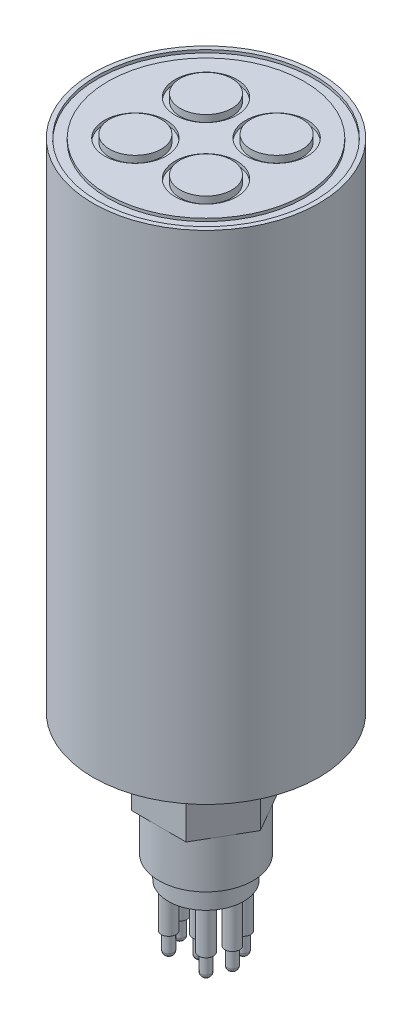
from build123d import *

# Parameters (mm, degrees)
SKETCH1_R                       = 22.86
BOSS_EXTRUDE1_DEPTH             = 100.584
SKETCH2_R                       = 21.9456
SKETCH2_R_2                     = 19.8628
CUT_EXTRUDE1_DEPTH              = 0.5842
SKETCH4_R                       = 6.25475
CUT_EXTRUDE4_DEPTH              = 0.7112
SKETCH5_R                       = 5.2324
BOSS_EXTRUDE2_DEPTH             = 1.397
BOSS_EXTRUDE3_DEPTH             = 15.24
SKETCH8_R                       = 9.525
BOSS_EXTRUDE4_DEPTH             = 9.525
SKETCH9_R                       = 7.62
BOSS_EXTRUDE5_DEPTH             = 4.572
SKETCH10_R                      = 1.4859
BOSS_EXTRUDE6_DEPTH             = 8.89
SKETCH12_R                      = 1.016
BOSS_EXTRUDE7_DEPTH             = 4.318
FILLET4_R                       = 0.9525
CIRPATTERN1_COUNT               = 7
CIRPATTERN1_ANGLE               = 270
FILLET4_OF_CIRPATTERN1_R        = 0.9525
LPATTERN2_COUNT                 = 2
LPATTERN2_PITCH                 = 3.7719
LPATTERN2_COUNT_DIR2            = 2
LPATTERN2_PITCH_DIR2            = 2.54
FILLET4_OF_LPATTERN2_R          = 0.9525
F_6_32_TAPPED_HOLE1_D           = 2.7051
F_6_32_TAPPED_HOLE1_DEPTH       = 9.398
F_6_32_TAPPED_HOLE1_CBORE_D     = 3.5052
F_6_32_TAPPED_HOLE1_CBORE_DEPTH = 7.112
F_6_32_TAPPED_HOLE1_TIP         = 0.81269403


with BuildPart() as part:
    # Sketch1 → Boss-Extrude1 (new body)
    with BuildSketch(Plane(origin=(0, 0, 0), x_dir=(1, 0, 0), z_dir=(0, 1, 0))):
        with Locations(Location((0, 0, 0), (0, 0, 270))):
            Circle(SKETCH1_R)
    extrude(amount=BOSS_EXTRUDE1_DEPTH)

    # Sketch2 → Cut-Extrude1 (cut)
    with BuildSketch(Plane(origin=(0, 100.584, 0), x_dir=(1, 0, 0), z_dir=(0, 1, 0))):
        with Locations(Location((0, 0, 0), (0, 0, 270))):
            Circle(SKETCH2_R)
        with Locations(Location((0, 0, 0), (0, 0, 270))):
            Circle(SKETCH2_R_2, mode=Mode.SUBTRACT)
    extrude(amount=-CUT_EXTRUDE1_DEPTH, mode=Mode.SUBTRACT)

    # Sketch4 → Cut-Extrude4 (cut)
    with BuildSketch(Plane(origin=(0, 100.584, 0), x_dir=(1, 0, 0), z_dir=(0, 1, 0))):
        with Locations(Location((-7.14375, 7.14375, 0), (0, 0, 270))):
            Circle(SKETCH4_R)
        with Locations(Location((7.14375, 7.14375, 0), (0, 0, 90))):
            Circle(SKETCH4_R)
        with Locations(Location((7.14375, -7.14375, 0), (0, 0, 270))):
            Circle(SKETCH4_R)
        with Locations(Location((-7.14375, -7.14375, 0), (0, 0, 90))):
            Circle(SKETCH4_R)
    extrude(amount=-CUT_EXTRUDE4_DEPTH, mode=Mode.SUBTRACT)

    # Sketch5 → Boss-Extrude2 (add)
    with BuildSketch(Plane(origin=(0, 99.8728, 0), x_dir=(1, 0, 0), z_dir=(0, 1, 0))):
        with Locations(Location((-7.14375, 7.14375, 0), (0, 0, 270))):
            Circle(SKETCH5_R)
        with Locations(Location((7.14375, 7.14375, 0), (0, 0, 90))):
            Circle(SKETCH5_R)
        with Locations(Location((7.14375, -7.14375, 0), (0, 0, 270))):
            Circle(SKETCH5_R)
        with Locations(Location((-7.14375, -7.14375, 0), (0, 0, 90))):
            Circle(SKETCH5_R)
    extrude(amount=BOSS_EXTRUDE2_DEPTH)

    # Sketch7 → Boss-Extrude3 (add)
    with BuildSketch(Plane.XZ):
        Polygon((5.499261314, 9.525), (-5.499261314, 9.525), (-10.998522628, 0), (-5.499261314, -9.525), (5.499261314, -9.525), (10.998522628, 0), align=None)
    extrude(amount=BOSS_EXTRUDE3_DEPTH)

    # Sketch8 → Boss-Extrude4 (add)
    with BuildSketch(Plane.XZ.offset(15.24)):
        with Locations(Location((0, 0, 0), (0, 0, 270))):
            Circle(SKETCH8_R)
    extrude(amount=BOSS_EXTRUDE4_DEPTH)

    # Sketch9 → Boss-Extrude5 (add)
    with BuildSketch(Plane.XZ.offset(24.765)):
        with Locations(Location((0, 0, 0), (0, 0, 270))):
            Circle(SKETCH9_R)
    extrude(amount=BOSS_EXTRUDE5_DEPTH)

    # Sketch10 → Boss-Extrude6 (add)
    with BuildSketch(Plane.XZ.offset(29.337)):
        with Locations(Location((3.771707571, 3.771707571, 0), (0, 0, 270))):
            Circle(SKETCH10_R)
    boss_extrude6 = extrude(amount=BOSS_EXTRUDE6_DEPTH)

    # Sketch12 → Boss-Extrude7 (add)
    with BuildSketch(Plane.XZ.offset(38.227)):
        with Locations(Location((3.771707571, 3.771707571, 0), (0, 0, 270))):
            Circle(SKETCH12_R)
    boss_extrude7 = extrude(amount=BOSS_EXTRUDE7_DEPTH)

    # Fillet4
    fillet4_edges = [part.edges().sort_by_distance(p)[0] for p in [
        (3.771707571, -42.545, 4.787707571),
    ]]
    fillet(fillet4_edges, radius=FILLET4_R)

    # CirPattern1: Boss-Extrude6, Boss-Extrude7 ×7 about axis
    cirpattern1_axis = Axis((0, 0, 0), (0, 1, 0))
    add([boss_extrude6.rotate(cirpattern1_axis, i * CIRPATTERN1_ANGLE / (CIRPATTERN1_COUNT - 1)) for i in range(1, CIRPATTERN1_COUNT)])
    add([boss_extrude7.rotate(cirpattern1_axis, i * CIRPATTERN1_ANGLE / (CIRPATTERN1_COUNT - 1)) for i in range(1, CIRPATTERN1_COUNT)])

    # Fillet4 of CirPattern1
    fillet4_of_cirpattern1_edges = [part.edges().sort_by_distance(p)[0] for p in [
        (6.05242049, -42.545, 0.71842049),
        (4.787707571, -42.545, -3.771707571),
        (0.71842049, -42.545, -6.05242049),
        (-3.771707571, -42.545, -4.787707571),
        (-6.05242049, -42.545, -0.71842049),
        (-4.787707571, -42.545, 3.771707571),
    ]]
    fillet(fillet4_of_cirpattern1_edges, radius=FILLET4_OF_CIRPATTERN1_R)

    # LPattern2: Boss-Extrude6, Boss-Extrude7 2 × 2, 2 skipped
    with Locations(*[(-i * LPATTERN2_PITCH, 0, -j * LPATTERN2_PITCH_DIR2) for i in range(LPATTERN2_COUNT) for j in range(LPATTERN2_COUNT_DIR2) if (i, j) not in ((0, 0), (0, 1), (1, 0))]):
        add(boss_extrude6)
        add(boss_extrude7)

    # Fillet4 of LPattern2
    fillet4_of_lpattern2_edges = [part.edges().sort_by_distance(p)[0] for p in [
        (-0.000192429, -42.545, 2.247707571),
    ]]
    fillet(fillet4_of_lpattern2_edges, radius=FILLET4_OF_LPATTERN2_R)

    # 6-32 Tapped Hole1
    with Locations(Plane(origin=(0, 76.75668794, -22.86), x_dir=(-1, 0, 0), z_dir=(0, 0, -1))):
        with Locations((0, 0)):
            CounterBoreHole(F_6_32_TAPPED_HOLE1_D / 2, F_6_32_TAPPED_HOLE1_CBORE_D / 2, F_6_32_TAPPED_HOLE1_CBORE_DEPTH, depth=F_6_32_TAPPED_HOLE1_DEPTH)
            with Locations((0, 0, -(F_6_32_TAPPED_HOLE1_DEPTH + F_6_32_TAPPED_HOLE1_TIP / 2))):  # 118° drill point
                Cone(0, F_6_32_TAPPED_HOLE1_D / 2, F_6_32_TAPPED_HOLE1_TIP, mode=Mode.SUBTRACT)


solid = part.part
